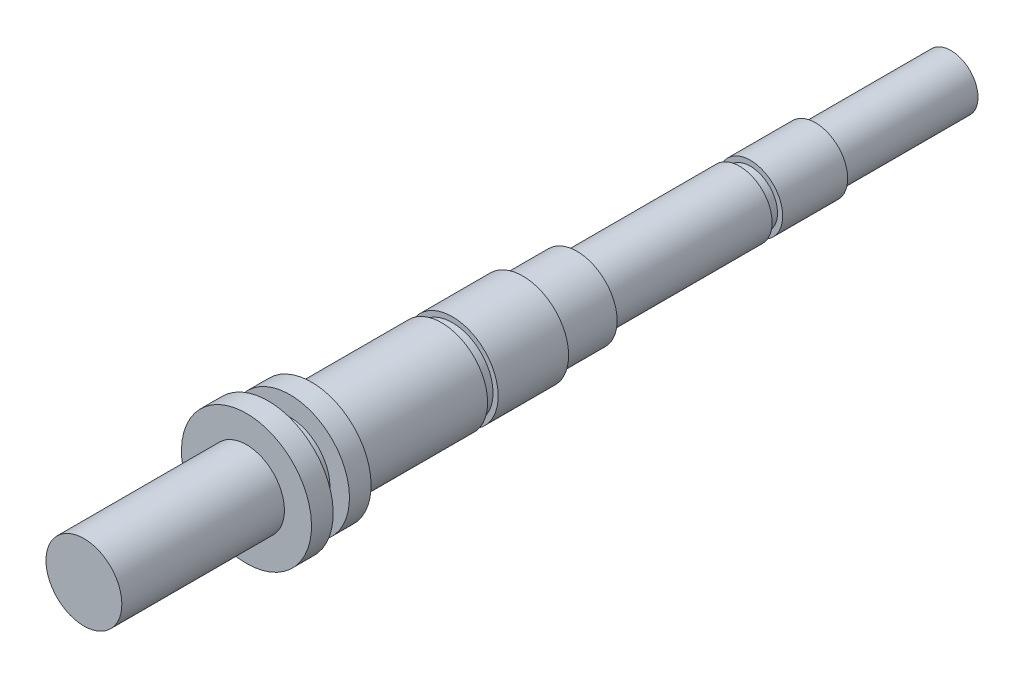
ISO-10303-21;
HEADER;
FILE_DESCRIPTION(('STEP AP214'),'2;1');
FILE_NAME('part.step','',(''),(''),'','','');
FILE_SCHEMA(('AUTOMOTIVE_DESIGN { 1 0 10303 214 1 1 1 1 }'));
ENDSEC;
DATA;
#1=APPLICATION_CONTEXT('core data for automotive mechanical design processes');
#2=APPLICATION_PROTOCOL_DEFINITION('international standard','automotive_design',2000,#1);
#3=PRODUCT_CONTEXT('',#1,'mechanical');
#4=PRODUCT('Part','Part','',(#3));
#5=PRODUCT_RELATED_PRODUCT_CATEGORY('part','',(#4));
#6=PRODUCT_DEFINITION_FORMATION('','',#4);
#7=PRODUCT_DEFINITION_CONTEXT('part definition',#1,'design');
#8=PRODUCT_DEFINITION('design','',#6,#7);
#9=PRODUCT_DEFINITION_SHAPE('','',#8);
#10=(LENGTH_UNIT() NAMED_UNIT(*) SI_UNIT(.MILLI.,.METRE.));
#11=(NAMED_UNIT(*) PLANE_ANGLE_UNIT() SI_UNIT($,.RADIAN.));
#12=(NAMED_UNIT(*) SI_UNIT($,.STERADIAN.) SOLID_ANGLE_UNIT());
#13=UNCERTAINTY_MEASURE_WITH_UNIT(LENGTH_MEASURE(1.E-05),#10,'distance_accuracy_value','');
#14=(GEOMETRIC_REPRESENTATION_CONTEXT(3) GLOBAL_UNCERTAINTY_ASSIGNED_CONTEXT((#13)) GLOBAL_UNIT_ASSIGNED_CONTEXT((#10,
#11,#12)) REPRESENTATION_CONTEXT('',''));
#15=CARTESIAN_POINT('',(0.,0.,0.));
#16=DIRECTION('',(0.,0.,1.));
#17=DIRECTION('',(1.,0.,0.));
#18=AXIS2_PLACEMENT_3D('',#15,#16,#17);
#19=CARTESIAN_POINT('',(0.,0.,82.));
#20=DIRECTION('',(0.,0.,-1.));
#21=DIRECTION('',(0.,1.,0.));
#22=AXIS2_PLACEMENT_3D('',#19,#20,#21);
#23=PLANE('',#22);
#24=CARTESIAN_POINT('',(0.,0.,82.));
#25=DIRECTION('',(0.,0.,1.));
#26=DIRECTION('',(0.,-1.,0.));
#27=AXIS2_PLACEMENT_3D('',#24,#25,#26);
#28=CIRCLE('',#27,6.99999999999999);
#29=CARTESIAN_POINT('',(0.,-6.99999999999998,82.));
#30=VERTEX_POINT('',#29);
#31=EDGE_CURVE('E10',#30,#30,#28,.T.);
#32=ORIENTED_EDGE('',*,*,#31,.T.);
#33=EDGE_LOOP('',(#32));
#34=FACE_BOUND('',#33,.T.);
#35=ADVANCED_FACE('F41',(#34),#23,.F.);
#36=CARTESIAN_POINT('',(0.,0.,126.394277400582));
#37=DIRECTION('',(0.,0.,1.));
#38=DIRECTION('',(0.,-1.,0.));
#39=AXIS2_PLACEMENT_3D('',#36,#37,#38);
#40=CYLINDRICAL_SURFACE('',#39,6.99999999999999);
#41=ORIENTED_EDGE('',*,*,#31,.F.);
#42=EDGE_LOOP('',(#41));
#43=FACE_BOUND('',#42,.T.);
#44=CARTESIAN_POINT('',(0.,0.,52.));
#45=DIRECTION('',(0.,0.,1.));
#46=DIRECTION('',(0.,-1.,0.));
#47=AXIS2_PLACEMENT_3D('',#44,#45,#46);
#48=CIRCLE('',#47,6.99999999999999);
#49=CARTESIAN_POINT('',(0.,-6.99999999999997,52.));
#50=VERTEX_POINT('',#49);
#51=EDGE_CURVE('E48',#50,#50,#48,.T.);
#52=ORIENTED_EDGE('',*,*,#51,.T.);
#53=EDGE_LOOP('',(#52));
#54=FACE_BOUND('',#53,.T.);
#55=ADVANCED_FACE('F157',(#43,#54),#40,.T.);
#56=CARTESIAN_POINT('',(0.,7.,52.));
#57=DIRECTION('',(0.,0.,-1.));
#58=DIRECTION('',(0.,1.,0.));
#59=AXIS2_PLACEMENT_3D('',#56,#57,#58);
#60=PLANE('',#59);
#61=ORIENTED_EDGE('',*,*,#51,.F.);
#62=EDGE_LOOP('',(#61));
#63=FACE_BOUND('',#62,.T.);
#64=CARTESIAN_POINT('',(0.,0.,52.));
#65=DIRECTION('',(0.,0.,1.));
#66=DIRECTION('',(0.,-1.,0.));
#67=AXIS2_PLACEMENT_3D('',#64,#65,#66);
#68=CIRCLE('',#67,12.);
#69=CARTESIAN_POINT('',(0.,-12.,52.));
#70=VERTEX_POINT('',#69);
#71=EDGE_CURVE('E53',#70,#70,#68,.T.);
#72=ORIENTED_EDGE('',*,*,#71,.T.);
#73=EDGE_LOOP('',(#72));
#74=FACE_BOUND('',#73,.T.);
#75=ADVANCED_FACE('F161',(#63,#74),#60,.F.);
#76=CARTESIAN_POINT('',(0.,0.,126.394277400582));
#77=DIRECTION('',(0.,0.,1.));
#78=DIRECTION('',(0.,-1.,0.));
#79=AXIS2_PLACEMENT_3D('',#76,#77,#78);
#80=CYLINDRICAL_SURFACE('',#79,12.);
#81=ORIENTED_EDGE('',*,*,#71,.F.);
#82=EDGE_LOOP('',(#81));
#83=FACE_BOUND('',#82,.T.);
#84=CARTESIAN_POINT('',(0.,0.,48.));
#85=DIRECTION('',(0.,0.,1.));
#86=DIRECTION('',(0.,-1.,0.));
#87=AXIS2_PLACEMENT_3D('',#84,#85,#86);
#88=CIRCLE('',#87,12.);
#89=CARTESIAN_POINT('',(0.,-12.,48.));
#90=VERTEX_POINT('',#89);
#91=EDGE_CURVE('E58',#90,#90,#88,.T.);
#92=ORIENTED_EDGE('',*,*,#91,.T.);
#93=EDGE_LOOP('',(#92));
#94=FACE_BOUND('',#93,.T.);
#95=ADVANCED_FACE('F166',(#83,#94),#80,.T.);
#96=CARTESIAN_POINT('',(0.,12.,48.));
#97=DIRECTION('',(0.,0.,1.));
#98=DIRECTION('',(0.,-1.,0.));
#99=AXIS2_PLACEMENT_3D('',#96,#97,#98);
#100=PLANE('',#99);
#101=ORIENTED_EDGE('',*,*,#91,.F.);
#102=EDGE_LOOP('',(#101));
#103=FACE_BOUND('',#102,.T.);
#104=CARTESIAN_POINT('',(0.,0.,48.));
#105=DIRECTION('',(0.,0.,1.));
#106=DIRECTION('',(0.,-1.,0.));
#107=AXIS2_PLACEMENT_3D('',#104,#105,#106);
#108=CIRCLE('',#107,7.39999999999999);
#109=CARTESIAN_POINT('',(0.,-7.39999999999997,48.));
#110=VERTEX_POINT('',#109);
#111=EDGE_CURVE('E64',#110,#110,#108,.T.);
#112=ORIENTED_EDGE('',*,*,#111,.T.);
#113=EDGE_LOOP('',(#112));
#114=FACE_BOUND('',#113,.T.);
#115=ADVANCED_FACE('F172',(#103,#114),#100,.F.);
#116=CARTESIAN_POINT('',(0.,0.,126.394277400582));
#117=DIRECTION('',(0.,0.,1.));
#118=DIRECTION('',(0.,-1.,0.));
#119=AXIS2_PLACEMENT_3D('',#116,#117,#118);
#120=CYLINDRICAL_SURFACE('',#119,7.39999999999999);
#121=ORIENTED_EDGE('',*,*,#111,.F.);
#122=EDGE_LOOP('',(#121));
#123=FACE_BOUND('',#122,.T.);
#124=CARTESIAN_POINT('',(0.,0.,44.));
#125=DIRECTION('',(0.,0.,1.));
#126=DIRECTION('',(0.,-1.,0.));
#127=AXIS2_PLACEMENT_3D('',#124,#125,#126);
#128=CIRCLE('',#127,7.39999999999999);
#129=CARTESIAN_POINT('',(0.,-7.39999999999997,44.));
#130=VERTEX_POINT('',#129);
#131=EDGE_CURVE('E68',#130,#130,#128,.T.);
#132=ORIENTED_EDGE('',*,*,#131,.T.);
#133=EDGE_LOOP('',(#132));
#134=FACE_BOUND('',#133,.T.);
#135=ADVANCED_FACE('F176',(#123,#134),#120,.T.);
#136=CARTESIAN_POINT('',(0.,7.4,44.));
#137=DIRECTION('',(0.,0.,-1.));
#138=DIRECTION('',(0.,1.,0.));
#139=AXIS2_PLACEMENT_3D('',#136,#137,#138);
#140=PLANE('',#139);
#141=ORIENTED_EDGE('',*,*,#131,.F.);
#142=EDGE_LOOP('',(#141));
#143=FACE_BOUND('',#142,.T.);
#144=CARTESIAN_POINT('',(0.,0.,44.));
#145=DIRECTION('',(0.,0.,1.));
#146=DIRECTION('',(0.,-1.,0.));
#147=AXIS2_PLACEMENT_3D('',#144,#145,#146);
#148=CIRCLE('',#147,11.);
#149=CARTESIAN_POINT('',(0.,-11.,44.));
#150=VERTEX_POINT('',#149);
#151=EDGE_CURVE('E72',#150,#150,#148,.T.);
#152=ORIENTED_EDGE('',*,*,#151,.T.);
#153=EDGE_LOOP('',(#152));
#154=FACE_BOUND('',#153,.T.);
#155=ADVANCED_FACE('F180',(#143,#154),#140,.F.);
#156=CARTESIAN_POINT('',(0.,0.,126.394277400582));
#157=DIRECTION('',(0.,0.,1.));
#158=DIRECTION('',(0.,-1.,0.));
#159=AXIS2_PLACEMENT_3D('',#156,#157,#158);
#160=CYLINDRICAL_SURFACE('',#159,11.);
#161=ORIENTED_EDGE('',*,*,#151,.F.);
#162=EDGE_LOOP('',(#161));
#163=FACE_BOUND('',#162,.T.);
#164=CARTESIAN_POINT('',(0.,0.,40.));
#165=DIRECTION('',(0.,0.,1.));
#166=DIRECTION('',(0.,-1.,0.));
#167=AXIS2_PLACEMENT_3D('',#164,#165,#166);
#168=CIRCLE('',#167,11.);
#169=CARTESIAN_POINT('',(0.,-11.,40.));
#170=VERTEX_POINT('',#169);
#171=EDGE_CURVE('E76',#170,#170,#168,.T.);
#172=ORIENTED_EDGE('',*,*,#171,.T.);
#173=EDGE_LOOP('',(#172));
#174=FACE_BOUND('',#173,.T.);
#175=ADVANCED_FACE('F184',(#163,#174),#160,.T.);
#176=CARTESIAN_POINT('',(0.,11.,40.));
#177=DIRECTION('',(0.,0.,1.));
#178=DIRECTION('',(0.,-1.,0.));
#179=AXIS2_PLACEMENT_3D('',#176,#177,#178);
#180=PLANE('',#179);
#181=ORIENTED_EDGE('',*,*,#171,.F.);
#182=EDGE_LOOP('',(#181));
#183=FACE_BOUND('',#182,.T.);
#184=CARTESIAN_POINT('',(0.,0.,40.));
#185=DIRECTION('',(0.,0.,1.));
#186=DIRECTION('',(0.,-1.,0.));
#187=AXIS2_PLACEMENT_3D('',#184,#185,#186);
#188=CIRCLE('',#187,8.49999999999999);
#189=CARTESIAN_POINT('',(0.,-8.49999999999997,40.));
#190=VERTEX_POINT('',#189);
#191=EDGE_CURVE('E80',#190,#190,#188,.T.);
#192=ORIENTED_EDGE('',*,*,#191,.T.);
#193=EDGE_LOOP('',(#192));
#194=FACE_BOUND('',#193,.T.);
#195=ADVANCED_FACE('F188',(#183,#194),#180,.F.);
#196=CARTESIAN_POINT('',(0.,0.,126.394277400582));
#197=DIRECTION('',(0.,0.,1.));
#198=DIRECTION('',(0.,-1.,0.));
#199=AXIS2_PLACEMENT_3D('',#196,#197,#198);
#200=CYLINDRICAL_SURFACE('',#199,8.49999999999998);
#201=ORIENTED_EDGE('',*,*,#191,.F.);
#202=EDGE_LOOP('',(#201));
#203=FACE_BOUND('',#202,.T.);
#204=CARTESIAN_POINT('',(0.,0.,16.));
#205=DIRECTION('',(0.,0.,1.));
#206=DIRECTION('',(0.,-1.,0.));
#207=AXIS2_PLACEMENT_3D('',#204,#205,#206);
#208=CIRCLE('',#207,8.49999999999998);
#209=CARTESIAN_POINT('',(0.,-8.49999999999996,16.));
#210=VERTEX_POINT('',#209);
#211=EDGE_CURVE('E84',#210,#210,#208,.T.);
#212=ORIENTED_EDGE('',*,*,#211,.T.);
#213=EDGE_LOOP('',(#212));
#214=FACE_BOUND('',#213,.T.);
#215=ADVANCED_FACE('F192',(#203,#214),#200,.T.);
#216=CARTESIAN_POINT('',(0.,8.5,16.));
#217=DIRECTION('',(0.,0.,1.));
#218=DIRECTION('',(0.,-1.,0.));
#219=AXIS2_PLACEMENT_3D('',#216,#217,#218);
#220=PLANE('',#219);
#221=ORIENTED_EDGE('',*,*,#211,.F.);
#222=EDGE_LOOP('',(#221));
#223=FACE_BOUND('',#222,.T.);
#224=CARTESIAN_POINT('',(0.,0.,16.));
#225=DIRECTION('',(0.,0.,1.));
#226=DIRECTION('',(0.,-1.,0.));
#227=AXIS2_PLACEMENT_3D('',#224,#225,#226);
#228=CIRCLE('',#227,7.49999999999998);
#229=CARTESIAN_POINT('',(0.,-7.49999999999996,16.));
#230=VERTEX_POINT('',#229);
#231=EDGE_CURVE('E88',#230,#230,#228,.T.);
#232=ORIENTED_EDGE('',*,*,#231,.T.);
#233=EDGE_LOOP('',(#232));
#234=FACE_BOUND('',#233,.T.);
#235=ADVANCED_FACE('F196',(#223,#234),#220,.F.);
#236=CARTESIAN_POINT('',(0.,0.,126.394277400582));
#237=DIRECTION('',(0.,0.,1.));
#238=DIRECTION('',(0.,-1.,0.));
#239=AXIS2_PLACEMENT_3D('',#236,#237,#238);
#240=CYLINDRICAL_SURFACE('',#239,7.49999999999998);
#241=ORIENTED_EDGE('',*,*,#231,.F.);
#242=EDGE_LOOP('',(#241));
#243=FACE_BOUND('',#242,.T.);
#244=CARTESIAN_POINT('',(0.,0.,14.));
#245=DIRECTION('',(0.,0.,1.));
#246=DIRECTION('',(0.,-1.,0.));
#247=AXIS2_PLACEMENT_3D('',#244,#245,#246);
#248=CIRCLE('',#247,7.49999999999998);
#249=CARTESIAN_POINT('',(0.,-7.49999999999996,14.));
#250=VERTEX_POINT('',#249);
#251=EDGE_CURVE('E92',#250,#250,#248,.T.);
#252=ORIENTED_EDGE('',*,*,#251,.T.);
#253=EDGE_LOOP('',(#252));
#254=FACE_BOUND('',#253,.T.);
#255=ADVANCED_FACE('F200',(#243,#254),#240,.T.);
#256=CARTESIAN_POINT('',(0.,7.5,14.));
#257=DIRECTION('',(0.,0.,-1.));
#258=DIRECTION('',(0.,1.,0.));
#259=AXIS2_PLACEMENT_3D('',#256,#257,#258);
#260=PLANE('',#259);
#261=ORIENTED_EDGE('',*,*,#251,.F.);
#262=EDGE_LOOP('',(#261));
#263=FACE_BOUND('',#262,.T.);
#264=CARTESIAN_POINT('',(0.,0.,14.));
#265=DIRECTION('',(0.,0.,1.));
#266=DIRECTION('',(0.,-1.,0.));
#267=AXIS2_PLACEMENT_3D('',#264,#265,#266);
#268=CIRCLE('',#267,8.44999999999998);
#269=CARTESIAN_POINT('',(0.,-8.44999999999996,14.));
#270=VERTEX_POINT('',#269);
#271=EDGE_CURVE('E96',#270,#270,#268,.T.);
#272=ORIENTED_EDGE('',*,*,#271,.T.);
#273=EDGE_LOOP('',(#272));
#274=FACE_BOUND('',#273,.T.);
#275=ADVANCED_FACE('F204',(#263,#274),#260,.F.);
#276=CARTESIAN_POINT('',(0.,0.,126.394277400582));
#277=DIRECTION('',(0.,0.,1.));
#278=DIRECTION('',(0.,-1.,0.));
#279=AXIS2_PLACEMENT_3D('',#276,#277,#278);
#280=CYLINDRICAL_SURFACE('',#279,8.44999999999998);
#281=ORIENTED_EDGE('',*,*,#271,.F.);
#282=EDGE_LOOP('',(#281));
#283=FACE_BOUND('',#282,.T.);
#284=CARTESIAN_POINT('',(0.,0.,1.00000000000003));
#285=DIRECTION('',(0.,0.,1.));
#286=DIRECTION('',(0.,-1.,0.));
#287=AXIS2_PLACEMENT_3D('',#284,#285,#286);
#288=CIRCLE('',#287,8.44999999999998);
#289=CARTESIAN_POINT('',(0.,-8.44999999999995,1.00000000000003));
#290=VERTEX_POINT('',#289);
#291=EDGE_CURVE('E100',#290,#290,#288,.T.);
#292=ORIENTED_EDGE('',*,*,#291,.T.);
#293=EDGE_LOOP('',(#292));
#294=FACE_BOUND('',#293,.T.);
#295=ADVANCED_FACE('F208',(#283,#294),#280,.T.);
#296=CARTESIAN_POINT('',(0.,8.45,1.00000000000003));
#297=DIRECTION('',(0.,0.,1.));
#298=DIRECTION('',(0.,-1.,0.));
#299=AXIS2_PLACEMENT_3D('',#296,#297,#298);
#300=PLANE('',#299);
#301=ORIENTED_EDGE('',*,*,#291,.F.);
#302=EDGE_LOOP('',(#301));
#303=FACE_BOUND('',#302,.T.);
#304=CARTESIAN_POINT('',(0.,0.,1.00000000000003));
#305=DIRECTION('',(0.,0.,1.));
#306=DIRECTION('',(0.,-1.,0.));
#307=AXIS2_PLACEMENT_3D('',#304,#305,#306);
#308=CIRCLE('',#307,7.39999999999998);
#309=CARTESIAN_POINT('',(0.,-7.39999999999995,1.00000000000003));
#310=VERTEX_POINT('',#309);
#311=EDGE_CURVE('E104',#310,#310,#308,.T.);
#312=ORIENTED_EDGE('',*,*,#311,.T.);
#313=EDGE_LOOP('',(#312));
#314=FACE_BOUND('',#313,.T.);
#315=ADVANCED_FACE('F212',(#303,#314),#300,.F.);
#316=CARTESIAN_POINT('',(0.,0.,126.394277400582));
#317=DIRECTION('',(0.,0.,1.));
#318=DIRECTION('',(0.,-1.,0.));
#319=AXIS2_PLACEMENT_3D('',#316,#317,#318);
#320=CYLINDRICAL_SURFACE('',#319,7.39999999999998);
#321=ORIENTED_EDGE('',*,*,#311,.F.);
#322=EDGE_LOOP('',(#321));
#323=FACE_BOUND('',#322,.T.);
#324=CARTESIAN_POINT('',(0.,0.,-9.00000000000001));
#325=DIRECTION('',(0.,0.,1.));
#326=DIRECTION('',(0.,-1.,0.));
#327=AXIS2_PLACEMENT_3D('',#324,#325,#326);
#328=CIRCLE('',#327,7.39999999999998);
#329=CARTESIAN_POINT('',(0.,-7.39999999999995,-9.00000000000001));
#330=VERTEX_POINT('',#329);
#331=EDGE_CURVE('E108',#330,#330,#328,.T.);
#332=ORIENTED_EDGE('',*,*,#331,.T.);
#333=EDGE_LOOP('',(#332));
#334=FACE_BOUND('',#333,.T.);
#335=ADVANCED_FACE('F216',(#323,#334),#320,.T.);
#336=CARTESIAN_POINT('',(0.,7.4,-9.00000000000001));
#337=DIRECTION('',(0.,0.,1.));
#338=DIRECTION('',(0.,-1.,0.));
#339=AXIS2_PLACEMENT_3D('',#336,#337,#338);
#340=PLANE('',#339);
#341=ORIENTED_EDGE('',*,*,#331,.F.);
#342=EDGE_LOOP('',(#341));
#343=FACE_BOUND('',#342,.T.);
#344=CARTESIAN_POINT('',(0.,0.,-9.00000000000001));
#345=DIRECTION('',(0.,0.,1.));
#346=DIRECTION('',(0.,-1.,0.));
#347=AXIS2_PLACEMENT_3D('',#344,#345,#346);
#348=CIRCLE('',#347,5.99999999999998);
#349=CARTESIAN_POINT('',(0.,-5.99999999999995,-9.00000000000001));
#350=VERTEX_POINT('',#349);
#351=EDGE_CURVE('E112',#350,#350,#348,.T.);
#352=ORIENTED_EDGE('',*,*,#351,.T.);
#353=EDGE_LOOP('',(#352));
#354=FACE_BOUND('',#353,.T.);
#355=ADVANCED_FACE('F220',(#343,#354),#340,.F.);
#356=CARTESIAN_POINT('',(0.,0.,126.394277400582));
#357=DIRECTION('',(0.,0.,1.));
#358=DIRECTION('',(0.,-1.,0.));
#359=AXIS2_PLACEMENT_3D('',#356,#357,#358);
#360=CYLINDRICAL_SURFACE('',#359,5.99999999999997);
#361=ORIENTED_EDGE('',*,*,#351,.F.);
#362=EDGE_LOOP('',(#361));
#363=FACE_BOUND('',#362,.T.);
#364=CARTESIAN_POINT('',(0.,0.,-39.));
#365=DIRECTION('',(0.,0.,1.));
#366=DIRECTION('',(0.,-1.,0.));
#367=AXIS2_PLACEMENT_3D('',#364,#365,#366);
#368=CIRCLE('',#367,5.99999999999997);
#369=CARTESIAN_POINT('',(0.,-5.99999999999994,-39.));
#370=VERTEX_POINT('',#369);
#371=EDGE_CURVE('E116',#370,#370,#368,.T.);
#372=ORIENTED_EDGE('',*,*,#371,.T.);
#373=EDGE_LOOP('',(#372));
#374=FACE_BOUND('',#373,.T.);
#375=ADVANCED_FACE('F224',(#363,#374),#360,.T.);
#376=CARTESIAN_POINT('',(0.,6.,-39.));
#377=DIRECTION('',(0.,0.,1.));
#378=DIRECTION('',(0.,-1.,0.));
#379=AXIS2_PLACEMENT_3D('',#376,#377,#378);
#380=PLANE('',#379);
#381=ORIENTED_EDGE('',*,*,#371,.F.);
#382=EDGE_LOOP('',(#381));
#383=FACE_BOUND('',#382,.T.);
#384=CARTESIAN_POINT('',(0.,0.,-39.));
#385=DIRECTION('',(0.,0.,1.));
#386=DIRECTION('',(0.,-1.,0.));
#387=AXIS2_PLACEMENT_3D('',#384,#385,#386);
#388=CIRCLE('',#387,4.99999999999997);
#389=CARTESIAN_POINT('',(0.,-4.99999999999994,-39.));
#390=VERTEX_POINT('',#389);
#391=EDGE_CURVE('E120',#390,#390,#388,.T.);
#392=ORIENTED_EDGE('',*,*,#391,.T.);
#393=EDGE_LOOP('',(#392));
#394=FACE_BOUND('',#393,.T.);
#395=ADVANCED_FACE('F228',(#383,#394),#380,.F.);
#396=CARTESIAN_POINT('',(0.,0.,126.394277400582));
#397=DIRECTION('',(0.,0.,1.));
#398=DIRECTION('',(0.,-1.,0.));
#399=AXIS2_PLACEMENT_3D('',#396,#397,#398);
#400=CYLINDRICAL_SURFACE('',#399,4.99999999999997);
#401=ORIENTED_EDGE('',*,*,#391,.F.);
#402=EDGE_LOOP('',(#401));
#403=FACE_BOUND('',#402,.T.);
#404=CARTESIAN_POINT('',(0.,0.,-41.));
#405=DIRECTION('',(0.,0.,1.));
#406=DIRECTION('',(0.,-1.,0.));
#407=AXIS2_PLACEMENT_3D('',#404,#405,#406);
#408=CIRCLE('',#407,4.99999999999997);
#409=CARTESIAN_POINT('',(0.,-4.99999999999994,-41.));
#410=VERTEX_POINT('',#409);
#411=EDGE_CURVE('E124',#410,#410,#408,.T.);
#412=ORIENTED_EDGE('',*,*,#411,.T.);
#413=EDGE_LOOP('',(#412));
#414=FACE_BOUND('',#413,.T.);
#415=ADVANCED_FACE('F232',(#403,#414),#400,.T.);
#416=CARTESIAN_POINT('',(0.,5.,-41.));
#417=DIRECTION('',(0.,0.,-1.));
#418=DIRECTION('',(0.,1.,0.));
#419=AXIS2_PLACEMENT_3D('',#416,#417,#418);
#420=PLANE('',#419);
#421=ORIENTED_EDGE('',*,*,#411,.F.);
#422=EDGE_LOOP('',(#421));
#423=FACE_BOUND('',#422,.T.);
#424=CARTESIAN_POINT('',(0.,0.,-41.));
#425=DIRECTION('',(0.,0.,1.));
#426=DIRECTION('',(0.,-1.,0.));
#427=AXIS2_PLACEMENT_3D('',#424,#425,#426);
#428=CIRCLE('',#427,5.94999999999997);
#429=CARTESIAN_POINT('',(0.,-5.94999999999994,-41.));
#430=VERTEX_POINT('',#429);
#431=EDGE_CURVE('E128',#430,#430,#428,.T.);
#432=ORIENTED_EDGE('',*,*,#431,.T.);
#433=EDGE_LOOP('',(#432));
#434=FACE_BOUND('',#433,.T.);
#435=ADVANCED_FACE('F236',(#423,#434),#420,.F.);
#436=CARTESIAN_POINT('',(0.,0.,126.394277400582));
#437=DIRECTION('',(0.,0.,1.));
#438=DIRECTION('',(0.,-1.,0.));
#439=AXIS2_PLACEMENT_3D('',#436,#437,#438);
#440=CYLINDRICAL_SURFACE('',#439,5.94999999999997);
#441=ORIENTED_EDGE('',*,*,#431,.F.);
#442=EDGE_LOOP('',(#441));
#443=FACE_BOUND('',#442,.T.);
#444=CARTESIAN_POINT('',(0.,0.,-53.));
#445=DIRECTION('',(0.,0.,1.));
#446=DIRECTION('',(0.,-1.,0.));
#447=AXIS2_PLACEMENT_3D('',#444,#445,#446);
#448=CIRCLE('',#447,5.94999999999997);
#449=CARTESIAN_POINT('',(0.,-5.94999999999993,-53.));
#450=VERTEX_POINT('',#449);
#451=EDGE_CURVE('E132',#450,#450,#448,.T.);
#452=ORIENTED_EDGE('',*,*,#451,.T.);
#453=EDGE_LOOP('',(#452));
#454=FACE_BOUND('',#453,.T.);
#455=ADVANCED_FACE('F240',(#443,#454),#440,.T.);
#456=CARTESIAN_POINT('',(0.,5.95,-53.));
#457=DIRECTION('',(0.,0.,1.));
#458=DIRECTION('',(0.,-1.,0.));
#459=AXIS2_PLACEMENT_3D('',#456,#457,#458);
#460=PLANE('',#459);
#461=ORIENTED_EDGE('',*,*,#451,.F.);
#462=EDGE_LOOP('',(#461));
#463=FACE_BOUND('',#462,.T.);
#464=CARTESIAN_POINT('',(0.,0.,-53.));
#465=DIRECTION('',(0.,0.,1.));
#466=DIRECTION('',(0.,-1.,0.));
#467=AXIS2_PLACEMENT_3D('',#464,#465,#466);
#468=CIRCLE('',#467,4.99999999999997);
#469=CARTESIAN_POINT('',(0.,-4.99999999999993,-53.));
#470=VERTEX_POINT('',#469);
#471=EDGE_CURVE('E136',#470,#470,#468,.T.);
#472=ORIENTED_EDGE('',*,*,#471,.T.);
#473=EDGE_LOOP('',(#472));
#474=FACE_BOUND('',#473,.T.);
#475=ADVANCED_FACE('F153',(#463,#474),#460,.F.);
#476=CARTESIAN_POINT('',(0.,0.,126.394277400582));
#477=DIRECTION('',(0.,0.,1.));
#478=DIRECTION('',(0.,-1.,0.));
#479=AXIS2_PLACEMENT_3D('',#476,#477,#478);
#480=CYLINDRICAL_SURFACE('',#479,4.99999999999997);
#481=ORIENTED_EDGE('',*,*,#471,.F.);
#482=EDGE_LOOP('',(#481));
#483=FACE_BOUND('',#482,.T.);
#484=CARTESIAN_POINT('',(0.,0.,-78.));
#485=DIRECTION('',(0.,0.,1.));
#486=DIRECTION('',(0.,-1.,0.));
#487=AXIS2_PLACEMENT_3D('',#484,#485,#486);
#488=CIRCLE('',#487,4.99999999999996);
#489=CARTESIAN_POINT('',(0.,-4.99999999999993,-78.));
#490=VERTEX_POINT('',#489);
#491=EDGE_CURVE('E140',#490,#490,#488,.T.);
#492=ORIENTED_EDGE('',*,*,#491,.T.);
#493=EDGE_LOOP('',(#492));
#494=FACE_BOUND('',#493,.T.);
#495=ADVANCED_FACE('F145',(#483,#494),#480,.T.);
#496=CARTESIAN_POINT('',(0.,5.,-78.));
#497=DIRECTION('',(0.,0.,1.));
#498=DIRECTION('',(0.,-1.,0.));
#499=AXIS2_PLACEMENT_3D('',#496,#497,#498);
#500=PLANE('',#499);
#501=ORIENTED_EDGE('',*,*,#491,.F.);
#502=EDGE_LOOP('',(#501));
#503=FACE_BOUND('',#502,.T.);
#504=ADVANCED_FACE('F147',(#503),#500,.F.);
#505=CLOSED_SHELL('',(#35,#55,#75,#95,#115,#135,#155,#175,#195,#215,#235,#255,#275,#295,#315,
#335,#355,#375,#395,#415,#435,#455,#475,#495,#504));
#506=MANIFOLD_SOLID_BREP('B2',#505);
#507=ADVANCED_BREP_SHAPE_REPRESENTATION('',(#18,#506),#14);
#508=SHAPE_DEFINITION_REPRESENTATION(#9,#507);
ENDSEC;
END-ISO-10303-21;
